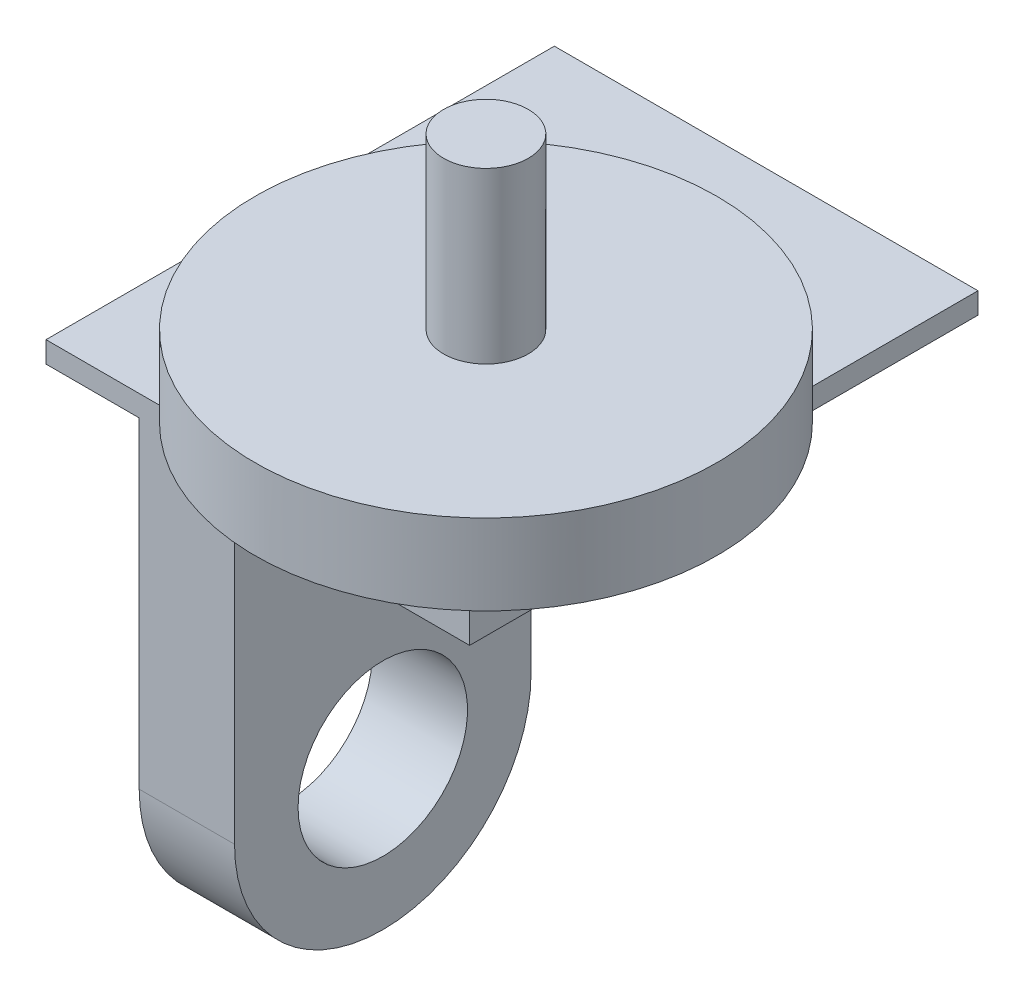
from build123d import *

# Parameters (mm, degrees)
SCHIZZO1_R                   = 40
ESTRUSIONE_ESTRUSIONE1_DEPTH = 45
SCHIZZO2_W                   = 156
SCHIZZO2_H                   = 140
ESTRUSIONE_ESTRUSIONE2_DEPTH = 25
ESTRUSIONE_ESTRUSIONE4_DEPTH = 10


with BuildPart() as part:
    # Schizzo1 → Estrusione-Estrusione1 (new body)
    with BuildSketch(Plane(origin=(0, 0, 0), x_dir=(0, 0, -1), z_dir=(1, 0, 0))):
        with BuildLine():
            Line((-70, 0), (-70, 136.8))
            Line((-70, 136.8), (70, 136.8))
            Line((70, 136.8), (70, 0))
            ThreePointArc((70, 0), (0, -70), (-70, 0))
        make_face()
        with Locations(Location((0, 0, 0), (0, 0, 180))):
            Circle(SCHIZZO1_R, mode=Mode.SUBTRACT)
    extrude(amount=ESTRUSIONE_ESTRUSIONE1_DEPTH)

    # Schizzo2 → Estrusione-Estrusione2 (add)
    with BuildSketch(Plane(origin=(0, 136.8, 0), x_dir=(1, 0, 0), z_dir=(0, 1, 0))):
        with Locations((78, 0)):
            Rectangle(SCHIZZO2_W, SCHIZZO2_H)
    extrude(amount=ESTRUSIONE_ESTRUSIONE2_DEPTH)

    # Schizzo5 → Estrusione-Estrusione4 (add)
    with BuildSketch(Plane(origin=(0, 161.8, 0), x_dir=(1, 0, 0), z_dir=(0, 1, 0))):
        Polygon((156, 170), (156, 70), (0, 70), (0, -70), (-44, -70), (-44, 170), align=None)
    extrude(amount=-ESTRUSIONE_ESTRUSIONE4_DEPTH)

    # Schizzo7 → Rivoluzione1 (revolve)
    with BuildSketch(Plane(origin=(93.7, 0, 0), x_dir=(0, 0, -1), z_dir=(1, 0, 0))):
        Polygon((0, 131.8), (48, 131.8), (48, 136.8), (30, 136.8), (30, 161.8), (109, 161.8), (109, 199.8), (20, 199.8), (20, 279.8), (0, 279.8), align=None)
    revolve(axis=Axis((93.7, -1000, 0), (0, 1, 0)))


solid = part.part
